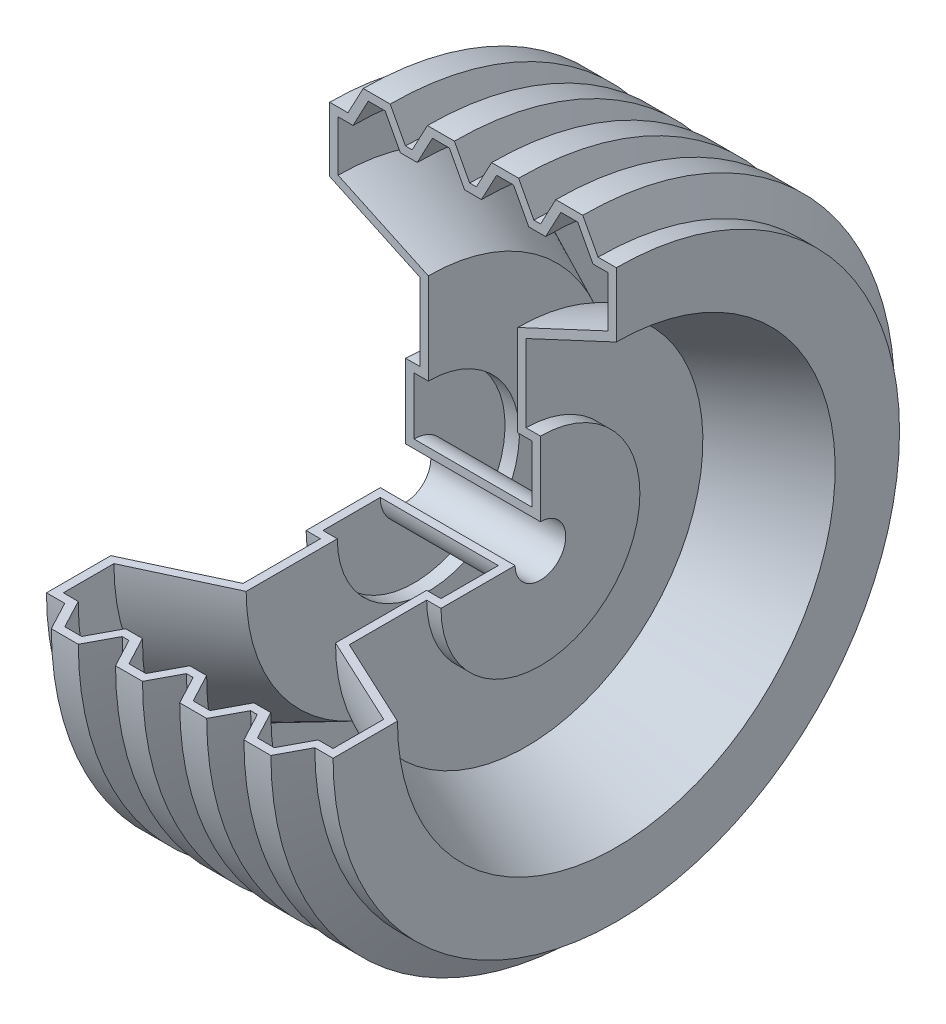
from build123d import *

# Parameters (mm, degrees)
REVOLVE_THIN1_ANGLE = 270


with BuildPart() as part:
    # Sketch1 → Revolve-Thin1 (revolve)
    with BuildSketch(Plane.XY):
        Polygon((-1.995696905, 168), (-11.034757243, 185), (-27.043363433, 185), (-36.082423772, 168), (-40.073817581, 168), (-49.11287792, 185), (-65.12148411, 185), (-74.160544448, 168), (-85, 168), (-85, 129.814648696), (-31.5, 104.867188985), (-31.5, 59), (-40, 59), (-40, 15), (40, 15), (40, 59), (31.5, 59), (31.5, 104.867188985), (85, 129.814648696), (85, 168), (74.160544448, 168), (65.12148411, 185), (49.11287792, 185), (40.073817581, 168), (36.082423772, 168), (27.043363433, 185), (11.034757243, 185), (1.995696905, 168), align=None)
        Polygon((-5, 163), (-14.039060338, 180), (-24.039060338, 180), (-33.078120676, 163), (-43.078120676, 163), (-52.117181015, 180), (-62.117181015, 180), (-71.156241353, 163), (-80, 163), (-80, 133), (-26.5, 108.052540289), (-26.5, 54), (-35, 54), (-35, 20), (35, 20), (35, 54), (26.5, 54), (26.5, 108.052540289), (80, 133), (80, 163), (71.156241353, 163), (62.117181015, 180), (52.117181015, 180), (43.078120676, 163), (33.078120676, 163), (24.039060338, 180), (14.039060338, 180), (5, 163), align=None, mode=Mode.SUBTRACT)
    revolve(axis=Axis((-56.654652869, 0, 0), (-1, 0, 0)), revolution_arc=REVOLVE_THIN1_ANGLE)


solid = part.part
